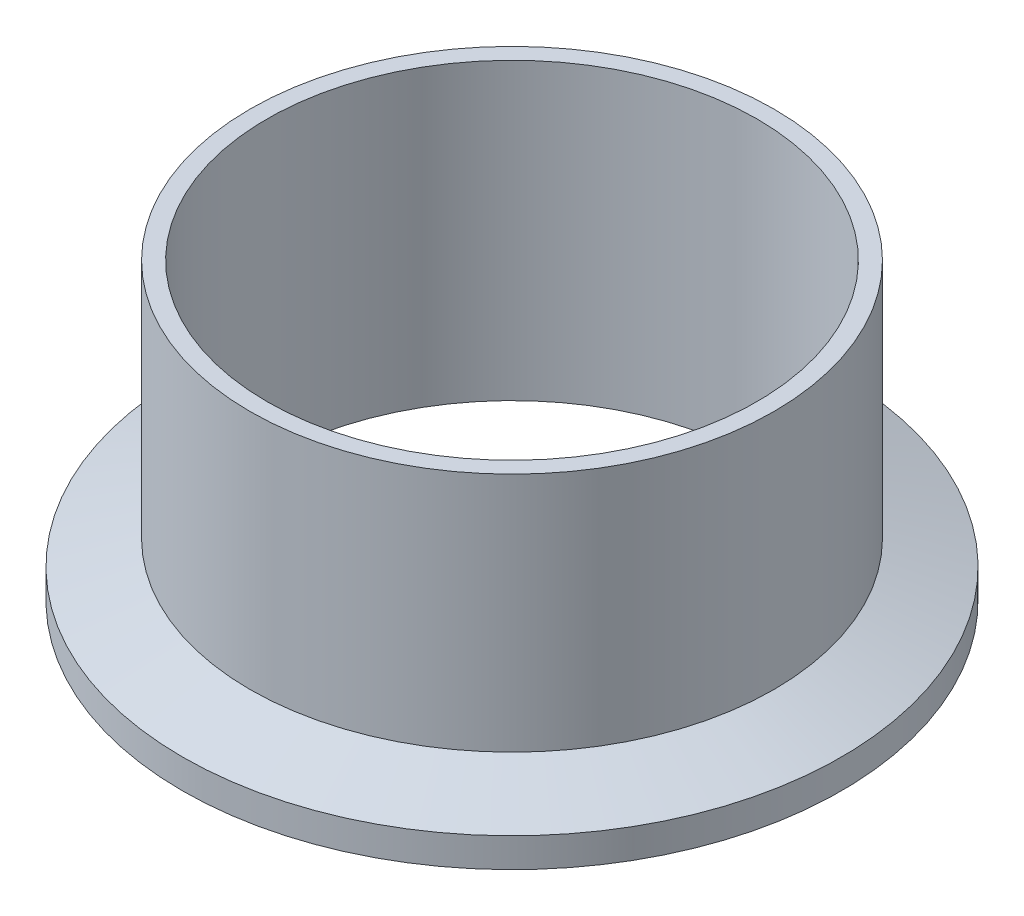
from build123d import *


with BuildPart() as part:
    # Sketch1 → Revolve2 (revolve)
    with BuildSketch(Plane.XY, mode=Mode.PRIVATE) as revolve2_sk:
        with BuildLine():
            Line((-23.749, 0), (-23.749, 28.575))
            Line((-23.749, 28.575), (-25.4, 28.575))
            Line((-25.4, 28.575), (-25.4, 5.229969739))
            Line((-25.4, 5.229969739), (-31.9532, 2.8448))
            Line((-31.9532, 2.8448), (-31.9532, 0))
            Line((-31.9532, 0), (-29.986608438, 0))
            ThreePointArc((-29.986608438, 0), (-29.554411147, 0.129217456), (-29.264066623, 0.474458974))
            ThreePointArc((-29.264066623, 0.474458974), (-28.1686, 1.1938), (-27.073133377, 0.474458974))
            ThreePointArc((-27.073133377, 0.474458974), (-26.782788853, 0.129217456), (-26.350591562, 0))
            Line((-26.350591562, 0), (-23.749, 0))
        make_face()
    revolve(revolve2_sk.sketch.rotate(Axis((0, 0, 0), (0, 1, 0)), 270), axis=Axis((0, 0, 0), (0, 1, 0)))


solid = part.part
